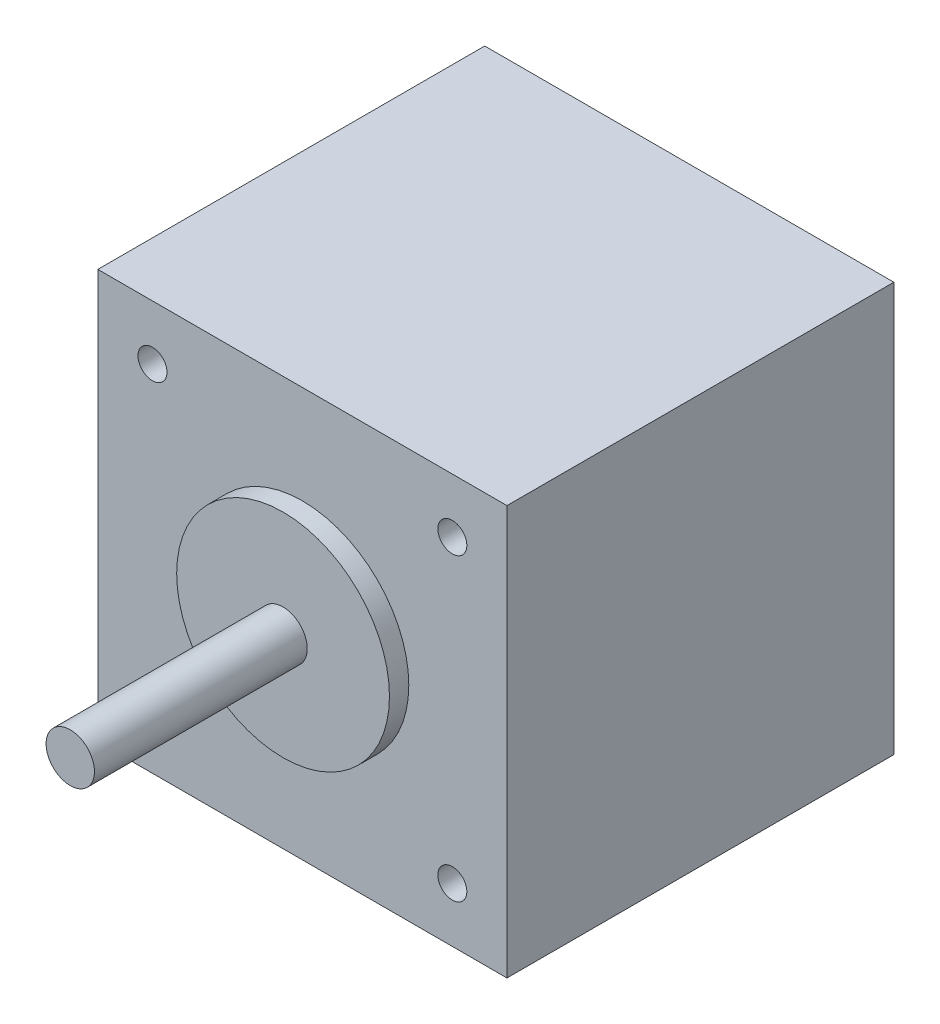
ISO-10303-21;
HEADER;
FILE_DESCRIPTION(('STEP AP214'),'2;1');
FILE_NAME('part.step','',(''),(''),'','','');
FILE_SCHEMA(('AUTOMOTIVE_DESIGN { 1 0 10303 214 1 1 1 1 }'));
ENDSEC;
DATA;
#1=APPLICATION_CONTEXT('core data for automotive mechanical design processes');
#2=APPLICATION_PROTOCOL_DEFINITION('international standard','automotive_design',2000,#1);
#3=PRODUCT_CONTEXT('',#1,'mechanical');
#4=PRODUCT('Part','Part','',(#3));
#5=PRODUCT_RELATED_PRODUCT_CATEGORY('part','',(#4));
#6=PRODUCT_DEFINITION_FORMATION('','',#4);
#7=PRODUCT_DEFINITION_CONTEXT('part definition',#1,'design');
#8=PRODUCT_DEFINITION('design','',#6,#7);
#9=PRODUCT_DEFINITION_SHAPE('','',#8);
#10=(LENGTH_UNIT() NAMED_UNIT(*) SI_UNIT(.MILLI.,.METRE.));
#11=(NAMED_UNIT(*) PLANE_ANGLE_UNIT() SI_UNIT($,.RADIAN.));
#12=(NAMED_UNIT(*) SI_UNIT($,.STERADIAN.) SOLID_ANGLE_UNIT());
#13=UNCERTAINTY_MEASURE_WITH_UNIT(LENGTH_MEASURE(1.E-05),#10,'distance_accuracy_value','');
#14=(GEOMETRIC_REPRESENTATION_CONTEXT(3) GLOBAL_UNCERTAINTY_ASSIGNED_CONTEXT((#13)) GLOBAL_UNIT_ASSIGNED_CONTEXT((#10,
#11,#12)) REPRESENTATION_CONTEXT('',''));
#15=CARTESIAN_POINT('',(0.,0.,0.));
#16=DIRECTION('',(0.,0.,1.));
#17=DIRECTION('',(1.,0.,0.));
#18=AXIS2_PLACEMENT_3D('',#15,#16,#17);
#19=CARTESIAN_POINT('',(21.15,21.15,42.));
#20=DIRECTION('',(0.,0.,1.));
#21=DIRECTION('',(1.,0.,0.));
#22=AXIS2_PLACEMENT_3D('',#19,#20,#21);
#23=PLANE('',#22);
#24=CARTESIAN_POINT('',(21.15,21.15,42.));
#25=DIRECTION('',(0.,0.,1.));
#26=DIRECTION('',(1.,0.,0.));
#27=AXIS2_PLACEMENT_3D('',#24,#25,#26);
#28=CIRCLE('',#27,11.);
#29=CARTESIAN_POINT('',(32.15,21.15,42.));
#30=VERTEX_POINT('',#29);
#31=EDGE_CURVE('E104',#30,#30,#28,.T.);
#32=ORIENTED_EDGE('',*,*,#31,.T.);
#33=EDGE_LOOP('',(#32));
#34=FACE_BOUND('',#33,.T.);
#35=CARTESIAN_POINT('',(21.15,21.15,42.));
#36=DIRECTION('',(0.,0.,1.));
#37=DIRECTION('',(1.,0.,0.));
#38=AXIS2_PLACEMENT_3D('',#35,#36,#37);
#39=CIRCLE('',#38,2.5);
#40=CARTESIAN_POINT('',(23.65,21.15,42.));
#41=VERTEX_POINT('',#40);
#42=EDGE_CURVE('E200',#41,#41,#39,.T.);
#43=ORIENTED_EDGE('',*,*,#42,.F.);
#44=EDGE_LOOP('',(#43));
#45=FACE_BOUND('',#44,.T.);
#46=ADVANCED_FACE('F33',(#34,#45),#23,.T.);
#47=CARTESIAN_POINT('',(0.,0.,40.));
#48=DIRECTION('',(0.,0.,-1.));
#49=DIRECTION('',(-1.,0.,0.));
#50=AXIS2_PLACEMENT_3D('',#47,#48,#49);
#51=PLANE('',#50);
#52=CARTESIAN_POINT('',(5.65,5.65,40.));
#53=DIRECTION('',(0.,0.,1.));
#54=DIRECTION('',(1.,0.,0.));
#55=AXIS2_PLACEMENT_3D('',#52,#53,#54);
#56=CIRCLE('',#55,1.5);
#57=CARTESIAN_POINT('',(7.15,5.65,40.));
#58=VERTEX_POINT('',#57);
#59=EDGE_CURVE('E180',#58,#58,#56,.T.);
#60=ORIENTED_EDGE('',*,*,#59,.F.);
#61=EDGE_LOOP('',(#60));
#62=FACE_BOUND('',#61,.T.);
#63=CARTESIAN_POINT('',(36.65,5.65,40.));
#64=DIRECTION('',(0.,0.,1.));
#65=DIRECTION('',(1.,0.,0.));
#66=AXIS2_PLACEMENT_3D('',#63,#64,#65);
#67=CIRCLE('',#66,1.5);
#68=CARTESIAN_POINT('',(38.15,5.65,40.));
#69=VERTEX_POINT('',#68);
#70=EDGE_CURVE('E179',#69,#69,#67,.T.);
#71=ORIENTED_EDGE('',*,*,#70,.F.);
#72=EDGE_LOOP('',(#71));
#73=FACE_BOUND('',#72,.T.);
#74=CARTESIAN_POINT('',(36.65,36.65,40.));
#75=DIRECTION('',(0.,0.,1.));
#76=DIRECTION('',(1.,0.,0.));
#77=AXIS2_PLACEMENT_3D('',#74,#75,#76);
#78=CIRCLE('',#77,1.5);
#79=CARTESIAN_POINT('',(38.15,36.65,40.));
#80=VERTEX_POINT('',#79);
#81=EDGE_CURVE('E189',#80,#80,#78,.T.);
#82=ORIENTED_EDGE('',*,*,#81,.F.);
#83=EDGE_LOOP('',(#82));
#84=FACE_BOUND('',#83,.T.);
#85=CARTESIAN_POINT('',(5.65,36.65,40.));
#86=DIRECTION('',(0.,0.,1.));
#87=DIRECTION('',(1.,0.,0.));
#88=AXIS2_PLACEMENT_3D('',#85,#86,#87);
#89=CIRCLE('',#88,1.50000000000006);
#90=CARTESIAN_POINT('',(7.15000000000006,36.65,40.));
#91=VERTEX_POINT('',#90);
#92=EDGE_CURVE('E194',#91,#91,#89,.T.);
#93=ORIENTED_EDGE('',*,*,#92,.F.);
#94=EDGE_LOOP('',(#93));
#95=FACE_BOUND('',#94,.T.);
#96=DIRECTION('',(0.,-1.,0.));
#97=VECTOR('',#96,1.);
#98=CARTESIAN_POINT('',(0.,0.,40.));
#99=LINE('',#98,#97);
#100=CARTESIAN_POINT('',(0.,42.3,40.));
#101=VERTEX_POINT('',#100);
#102=CARTESIAN_POINT('',(0.,0.,40.));
#103=VERTEX_POINT('',#102);
#104=EDGE_CURVE('E87',#101,#103,#99,.T.);
#105=ORIENTED_EDGE('',*,*,#104,.T.);
#106=DIRECTION('',(1.,0.,0.));
#107=VECTOR('',#106,1.);
#108=CARTESIAN_POINT('',(0.,0.,40.));
#109=LINE('',#108,#107);
#110=CARTESIAN_POINT('',(42.3,0.,40.));
#111=VERTEX_POINT('',#110);
#112=EDGE_CURVE('E81',#103,#111,#109,.T.);
#113=ORIENTED_EDGE('',*,*,#112,.T.);
#114=DIRECTION('',(0.,1.,0.));
#115=VECTOR('',#114,1.);
#116=CARTESIAN_POINT('',(42.3,0.,40.));
#117=LINE('',#116,#115);
#118=CARTESIAN_POINT('',(42.3,42.3,40.));
#119=VERTEX_POINT('',#118);
#120=EDGE_CURVE('E85',#111,#119,#117,.T.);
#121=ORIENTED_EDGE('',*,*,#120,.T.);
#122=DIRECTION('',(-1.,0.,0.));
#123=VECTOR('',#122,1.);
#124=CARTESIAN_POINT('',(0.,42.3,40.));
#125=LINE('',#124,#123);
#126=EDGE_CURVE('E50',#119,#101,#125,.T.);
#127=ORIENTED_EDGE('',*,*,#126,.T.);
#128=EDGE_LOOP('',(#105,#113,#121,#127));
#129=FACE_BOUND('',#128,.T.);
#130=CARTESIAN_POINT('',(21.15,21.15,40.));
#131=DIRECTION('',(0.,0.,-1.));
#132=DIRECTION('',(-1.,0.,0.));
#133=AXIS2_PLACEMENT_3D('',#130,#131,#132);
#134=CIRCLE('',#133,11.);
#135=CARTESIAN_POINT('',(10.15,21.15,40.));
#136=VERTEX_POINT('',#135);
#137=EDGE_CURVE('E11',#136,#136,#134,.F.);
#138=ORIENTED_EDGE('',*,*,#137,.F.);
#139=EDGE_LOOP('',(#138));
#140=FACE_BOUND('',#139,.T.);
#141=ADVANCED_FACE('F82',(#62,#73,#84,#95,#129,#140),#51,.F.);
#142=CARTESIAN_POINT('',(0.,0.,40.));
#143=DIRECTION('',(1.,0.,0.));
#144=DIRECTION('',(0.,0.,-1.));
#145=AXIS2_PLACEMENT_3D('',#142,#143,#144);
#146=PLANE('',#145);
#147=DIRECTION('',(0.,-1.,0.));
#148=VECTOR('',#147,1.);
#149=CARTESIAN_POINT('',(0.,0.,0.));
#150=LINE('',#149,#148);
#151=CARTESIAN_POINT('',(0.,42.3,0.));
#152=VERTEX_POINT('',#151);
#153=CARTESIAN_POINT('',(0.,0.,0.));
#154=VERTEX_POINT('',#153);
#155=EDGE_CURVE('E101',#152,#154,#150,.T.);
#156=ORIENTED_EDGE('',*,*,#155,.T.);
#157=DIRECTION('',(0.,0.,-1.));
#158=VECTOR('',#157,1.);
#159=CARTESIAN_POINT('',(0.,0.,40.));
#160=LINE('',#159,#158);
#161=EDGE_CURVE('E42',#103,#154,#160,.T.);
#162=ORIENTED_EDGE('',*,*,#161,.F.);
#163=ORIENTED_EDGE('',*,*,#104,.F.);
#164=DIRECTION('',(0.,0.,-1.));
#165=VECTOR('',#164,1.);
#166=CARTESIAN_POINT('',(0.,42.3,40.));
#167=LINE('',#166,#165);
#168=EDGE_CURVE('E97',#101,#152,#167,.T.);
#169=ORIENTED_EDGE('',*,*,#168,.T.);
#170=EDGE_LOOP('',(#156,#162,#163,#169));
#171=FACE_BOUND('',#170,.T.);
#172=ADVANCED_FACE('F35',(#171),#146,.F.);
#173=CARTESIAN_POINT('',(0.,0.,40.));
#174=DIRECTION('',(0.,1.,0.));
#175=DIRECTION('',(0.,0.,1.));
#176=AXIS2_PLACEMENT_3D('',#173,#174,#175);
#177=PLANE('',#176);
#178=DIRECTION('',(1.,0.,0.));
#179=VECTOR('',#178,1.);
#180=CARTESIAN_POINT('',(0.,0.,0.));
#181=LINE('',#180,#179);
#182=CARTESIAN_POINT('',(42.3,0.,0.));
#183=VERTEX_POINT('',#182);
#184=EDGE_CURVE('E92',#154,#183,#181,.T.);
#185=ORIENTED_EDGE('',*,*,#184,.T.);
#186=DIRECTION('',(0.,0.,-1.));
#187=VECTOR('',#186,1.);
#188=CARTESIAN_POINT('',(42.3,0.,40.));
#189=LINE('',#188,#187);
#190=EDGE_CURVE('E90',#111,#183,#189,.T.);
#191=ORIENTED_EDGE('',*,*,#190,.F.);
#192=ORIENTED_EDGE('',*,*,#112,.F.);
#193=ORIENTED_EDGE('',*,*,#161,.T.);
#194=EDGE_LOOP('',(#185,#191,#192,#193));
#195=FACE_BOUND('',#194,.T.);
#196=ADVANCED_FACE('F91',(#195),#177,.F.);
#197=CARTESIAN_POINT('',(42.3,0.,40.));
#198=DIRECTION('',(-1.,0.,0.));
#199=DIRECTION('',(0.,0.,1.));
#200=AXIS2_PLACEMENT_3D('',#197,#198,#199);
#201=PLANE('',#200);
#202=DIRECTION('',(0.,1.,0.));
#203=VECTOR('',#202,1.);
#204=CARTESIAN_POINT('',(42.3,0.,0.));
#205=LINE('',#204,#203);
#206=CARTESIAN_POINT('',(42.3,42.3,0.));
#207=VERTEX_POINT('',#206);
#208=EDGE_CURVE('E67',#183,#207,#205,.T.);
#209=ORIENTED_EDGE('',*,*,#208,.T.);
#210=DIRECTION('',(0.,0.,-1.));
#211=VECTOR('',#210,1.);
#212=CARTESIAN_POINT('',(42.3,42.3,40.));
#213=LINE('',#212,#211);
#214=EDGE_CURVE('E93',#119,#207,#213,.T.);
#215=ORIENTED_EDGE('',*,*,#214,.F.);
#216=ORIENTED_EDGE('',*,*,#120,.F.);
#217=ORIENTED_EDGE('',*,*,#190,.T.);
#218=EDGE_LOOP('',(#209,#215,#216,#217));
#219=FACE_BOUND('',#218,.T.);
#220=ADVANCED_FACE('F95',(#219),#201,.F.);
#221=CARTESIAN_POINT('',(0.,42.3,40.));
#222=DIRECTION('',(0.,-1.,0.));
#223=DIRECTION('',(0.,0.,-1.));
#224=AXIS2_PLACEMENT_3D('',#221,#222,#223);
#225=PLANE('',#224);
#226=DIRECTION('',(-1.,0.,0.));
#227=VECTOR('',#226,1.);
#228=CARTESIAN_POINT('',(0.,42.3,0.));
#229=LINE('',#228,#227);
#230=EDGE_CURVE('E73',#207,#152,#229,.T.);
#231=ORIENTED_EDGE('',*,*,#230,.T.);
#232=ORIENTED_EDGE('',*,*,#168,.F.);
#233=ORIENTED_EDGE('',*,*,#126,.F.);
#234=ORIENTED_EDGE('',*,*,#214,.T.);
#235=EDGE_LOOP('',(#231,#232,#233,#234));
#236=FACE_BOUND('',#235,.T.);
#237=ADVANCED_FACE('F115',(#236),#225,.F.);
#238=CARTESIAN_POINT('',(0.,0.,0.));
#239=DIRECTION('',(0.,0.,-1.));
#240=DIRECTION('',(-1.,0.,0.));
#241=AXIS2_PLACEMENT_3D('',#238,#239,#240);
#242=PLANE('',#241);
#243=ORIENTED_EDGE('',*,*,#155,.F.);
#244=ORIENTED_EDGE('',*,*,#230,.F.);
#245=ORIENTED_EDGE('',*,*,#208,.F.);
#246=ORIENTED_EDGE('',*,*,#184,.F.);
#247=EDGE_LOOP('',(#243,#244,#245,#246));
#248=FACE_BOUND('',#247,.T.);
#249=ADVANCED_FACE('F112',(#248),#242,.T.);
#250=CARTESIAN_POINT('',(21.15,21.15,42.));
#251=DIRECTION('',(0.,0.,-1.));
#252=DIRECTION('',(-1.,0.,0.));
#253=AXIS2_PLACEMENT_3D('',#250,#251,#252);
#254=CYLINDRICAL_SURFACE('',#253,11.);
#255=ORIENTED_EDGE('',*,*,#31,.F.);
#256=EDGE_LOOP('',(#255));
#257=FACE_BOUND('',#256,.T.);
#258=ORIENTED_EDGE('',*,*,#137,.T.);
#259=EDGE_LOOP('',(#258));
#260=FACE_BOUND('',#259,.T.);
#261=ADVANCED_FACE('F114',(#257,#260),#254,.T.);
#262=CARTESIAN_POINT('',(21.15,21.15,64.));
#263=DIRECTION('',(0.,0.,-1.));
#264=DIRECTION('',(-1.,0.,0.));
#265=AXIS2_PLACEMENT_3D('',#262,#263,#264);
#266=CYLINDRICAL_SURFACE('',#265,2.5);
#267=CARTESIAN_POINT('',(21.15,21.15,64.));
#268=DIRECTION('',(0.,0.,1.));
#269=DIRECTION('',(1.,0.,0.));
#270=AXIS2_PLACEMENT_3D('',#267,#268,#269);
#271=CIRCLE('',#270,2.5);
#272=CARTESIAN_POINT('',(23.65,21.15,64.));
#273=VERTEX_POINT('',#272);
#274=EDGE_CURVE('E203',#273,#273,#271,.T.);
#275=ORIENTED_EDGE('',*,*,#274,.F.);
#276=EDGE_LOOP('',(#275));
#277=FACE_BOUND('',#276,.T.);
#278=ORIENTED_EDGE('',*,*,#42,.T.);
#279=EDGE_LOOP('',(#278));
#280=FACE_BOUND('',#279,.T.);
#281=ADVANCED_FACE('F121',(#277,#280),#266,.T.);
#282=CARTESIAN_POINT('',(21.15,21.15,64.));
#283=DIRECTION('',(0.,0.,1.));
#284=DIRECTION('',(1.,0.,0.));
#285=AXIS2_PLACEMENT_3D('',#282,#283,#284);
#286=PLANE('',#285);
#287=ORIENTED_EDGE('',*,*,#274,.T.);
#288=EDGE_LOOP('',(#287));
#289=FACE_BOUND('',#288,.T.);
#290=ADVANCED_FACE('F138',(#289),#286,.T.);
#291=CARTESIAN_POINT('',(5.65,36.65,35.5));
#292=DIRECTION('',(0.,0.,1.));
#293=DIRECTION('',(1.,0.,0.));
#294=AXIS2_PLACEMENT_3D('',#291,#292,#293);
#295=CYLINDRICAL_SURFACE('',#294,1.50000000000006);
#296=CARTESIAN_POINT('',(5.65,36.65,35.5));
#297=DIRECTION('',(0.,0.,1.));
#298=DIRECTION('',(1.,0.,0.));
#299=AXIS2_PLACEMENT_3D('',#296,#297,#298);
#300=CIRCLE('',#299,1.50000000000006);
#301=CARTESIAN_POINT('',(7.15000000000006,36.65,35.5));
#302=VERTEX_POINT('',#301);
#303=EDGE_CURVE('E197',#302,#302,#300,.T.);
#304=ORIENTED_EDGE('',*,*,#303,.F.);
#305=EDGE_LOOP('',(#304));
#306=FACE_BOUND('',#305,.T.);
#307=ORIENTED_EDGE('',*,*,#92,.T.);
#308=EDGE_LOOP('',(#307));
#309=FACE_BOUND('',#308,.T.);
#310=ADVANCED_FACE('F142',(#306,#309),#295,.F.);
#311=CARTESIAN_POINT('',(5.65,36.65,35.5));
#312=DIRECTION('',(0.,0.,1.));
#313=DIRECTION('',(1.,0.,0.));
#314=AXIS2_PLACEMENT_3D('',#311,#312,#313);
#315=PLANE('',#314);
#316=ORIENTED_EDGE('',*,*,#303,.T.);
#317=EDGE_LOOP('',(#316));
#318=FACE_BOUND('',#317,.T.);
#319=ADVANCED_FACE('F146',(#318),#315,.T.);
#320=CARTESIAN_POINT('',(36.65,36.65,35.5));
#321=DIRECTION('',(0.,0.,1.));
#322=DIRECTION('',(1.,0.,0.));
#323=AXIS2_PLACEMENT_3D('',#320,#321,#322);
#324=CYLINDRICAL_SURFACE('',#323,1.5);
#325=CARTESIAN_POINT('',(36.65,36.65,35.5));
#326=DIRECTION('',(0.,0.,1.));
#327=DIRECTION('',(1.,0.,0.));
#328=AXIS2_PLACEMENT_3D('',#325,#326,#327);
#329=CIRCLE('',#328,1.5);
#330=CARTESIAN_POINT('',(38.15,36.65,35.5));
#331=VERTEX_POINT('',#330);
#332=EDGE_CURVE('E191',#331,#331,#329,.T.);
#333=ORIENTED_EDGE('',*,*,#332,.F.);
#334=EDGE_LOOP('',(#333));
#335=FACE_BOUND('',#334,.T.);
#336=ORIENTED_EDGE('',*,*,#81,.T.);
#337=EDGE_LOOP('',(#336));
#338=FACE_BOUND('',#337,.T.);
#339=ADVANCED_FACE('F150',(#335,#338),#324,.F.);
#340=CARTESIAN_POINT('',(36.65,36.65,35.5));
#341=DIRECTION('',(0.,0.,1.));
#342=DIRECTION('',(1.,0.,0.));
#343=AXIS2_PLACEMENT_3D('',#340,#341,#342);
#344=PLANE('',#343);
#345=ORIENTED_EDGE('',*,*,#332,.T.);
#346=EDGE_LOOP('',(#345));
#347=FACE_BOUND('',#346,.T.);
#348=ADVANCED_FACE('F154',(#347),#344,.T.);
#349=CARTESIAN_POINT('',(36.65,5.65,35.5));
#350=DIRECTION('',(0.,0.,1.));
#351=DIRECTION('',(1.,0.,0.));
#352=AXIS2_PLACEMENT_3D('',#349,#350,#351);
#353=CYLINDRICAL_SURFACE('',#352,1.5);
#354=CARTESIAN_POINT('',(36.65,5.65,35.5));
#355=DIRECTION('',(0.,0.,1.));
#356=DIRECTION('',(1.,0.,0.));
#357=AXIS2_PLACEMENT_3D('',#354,#355,#356);
#358=CIRCLE('',#357,1.5);
#359=CARTESIAN_POINT('',(38.15,5.65,35.5));
#360=VERTEX_POINT('',#359);
#361=EDGE_CURVE('E183',#360,#360,#358,.T.);
#362=ORIENTED_EDGE('',*,*,#361,.F.);
#363=EDGE_LOOP('',(#362));
#364=FACE_BOUND('',#363,.T.);
#365=ORIENTED_EDGE('',*,*,#70,.T.);
#366=EDGE_LOOP('',(#365));
#367=FACE_BOUND('',#366,.T.);
#368=ADVANCED_FACE('F158',(#364,#367),#353,.F.);
#369=CARTESIAN_POINT('',(36.65,5.65,35.5));
#370=DIRECTION('',(0.,0.,1.));
#371=DIRECTION('',(1.,0.,0.));
#372=AXIS2_PLACEMENT_3D('',#369,#370,#371);
#373=PLANE('',#372);
#374=ORIENTED_EDGE('',*,*,#361,.T.);
#375=EDGE_LOOP('',(#374));
#376=FACE_BOUND('',#375,.T.);
#377=ADVANCED_FACE('F162',(#376),#373,.T.);
#378=CARTESIAN_POINT('',(5.65,5.65,35.5));
#379=DIRECTION('',(0.,0.,1.));
#380=DIRECTION('',(1.,0.,0.));
#381=AXIS2_PLACEMENT_3D('',#378,#379,#380);
#382=CYLINDRICAL_SURFACE('',#381,1.5);
#383=CARTESIAN_POINT('',(5.65,5.65,35.5));
#384=DIRECTION('',(0.,0.,1.));
#385=DIRECTION('',(1.,0.,0.));
#386=AXIS2_PLACEMENT_3D('',#383,#384,#385);
#387=CIRCLE('',#386,1.5);
#388=CARTESIAN_POINT('',(7.15,5.65,35.5));
#389=VERTEX_POINT('',#388);
#390=EDGE_CURVE('E178',#389,#389,#387,.T.);
#391=ORIENTED_EDGE('',*,*,#390,.F.);
#392=EDGE_LOOP('',(#391));
#393=FACE_BOUND('',#392,.T.);
#394=ORIENTED_EDGE('',*,*,#59,.T.);
#395=EDGE_LOOP('',(#394));
#396=FACE_BOUND('',#395,.T.);
#397=ADVANCED_FACE('F166',(#393,#396),#382,.F.);
#398=CARTESIAN_POINT('',(5.65,5.65,35.5));
#399=DIRECTION('',(0.,0.,1.));
#400=DIRECTION('',(1.,0.,0.));
#401=AXIS2_PLACEMENT_3D('',#398,#399,#400);
#402=PLANE('',#401);
#403=ORIENTED_EDGE('',*,*,#390,.T.);
#404=EDGE_LOOP('',(#403));
#405=FACE_BOUND('',#404,.T.);
#406=ADVANCED_FACE('F170',(#405),#402,.T.);
#407=CLOSED_SHELL('',(#46,#141,#172,#196,#220,#237,#249,#261,#281,#290,#310,#319,#339,#348,#368,
#377,#397,#406));
#408=MANIFOLD_SOLID_BREP('B2',#407);
#409=ADVANCED_BREP_SHAPE_REPRESENTATION('',(#18,#408),#14);
#410=SHAPE_DEFINITION_REPRESENTATION(#9,#409);
ENDSEC;
END-ISO-10303-21;
